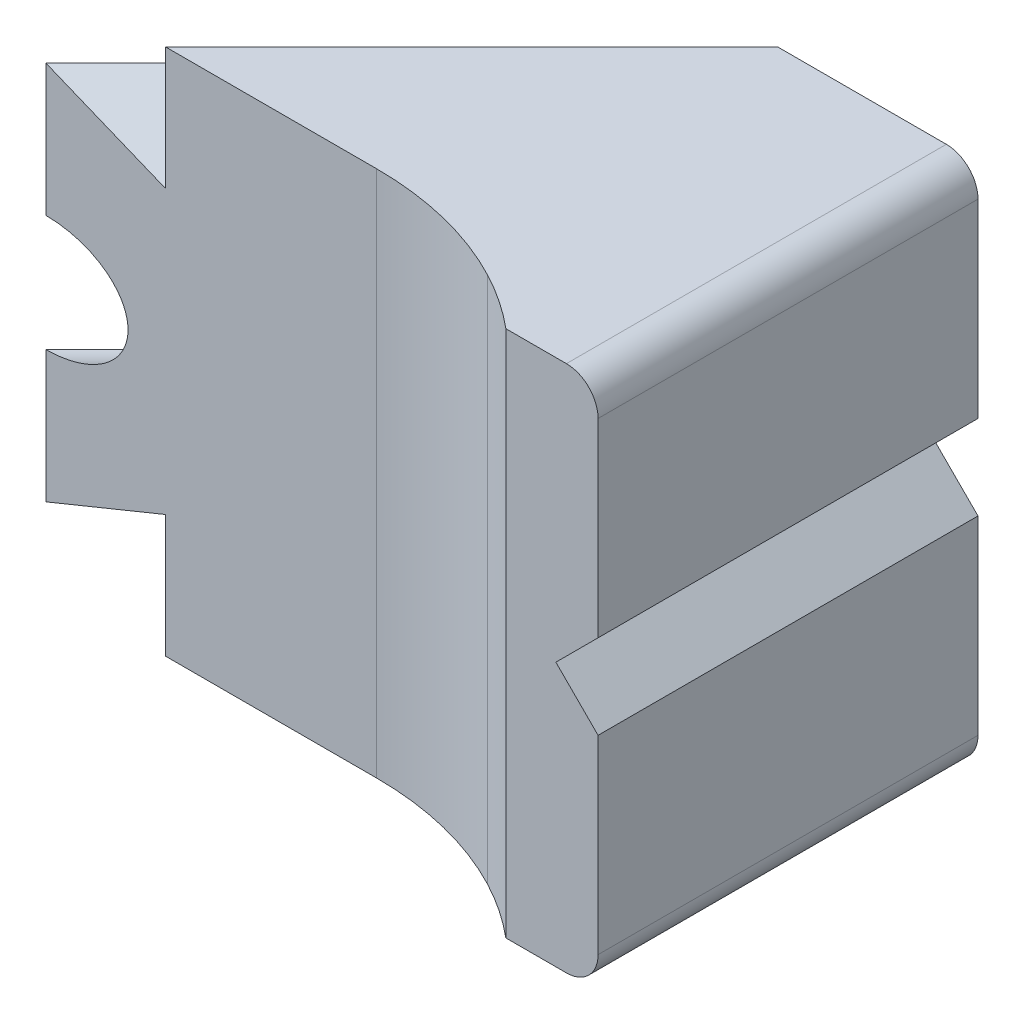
ISO-10303-21;
HEADER;
FILE_DESCRIPTION(('STEP AP214'),'2;1');
FILE_NAME('part.step','',(''),(''),'','','');
FILE_SCHEMA(('AUTOMOTIVE_DESIGN { 1 0 10303 214 1 1 1 1 }'));
ENDSEC;
DATA;
#1=APPLICATION_CONTEXT('core data for automotive mechanical design processes');
#2=APPLICATION_PROTOCOL_DEFINITION('international standard','automotive_design',2000,#1);
#3=PRODUCT_CONTEXT('',#1,'mechanical');
#4=PRODUCT('Part','Part','',(#3));
#5=PRODUCT_RELATED_PRODUCT_CATEGORY('part','',(#4));
#6=PRODUCT_DEFINITION_FORMATION('','',#4);
#7=PRODUCT_DEFINITION_CONTEXT('part definition',#1,'design');
#8=PRODUCT_DEFINITION('design','',#6,#7);
#9=PRODUCT_DEFINITION_SHAPE('','',#8);
#10=(LENGTH_UNIT() NAMED_UNIT(*) SI_UNIT(.MILLI.,.METRE.));
#11=(NAMED_UNIT(*) PLANE_ANGLE_UNIT() SI_UNIT($,.RADIAN.));
#12=(NAMED_UNIT(*) SI_UNIT($,.STERADIAN.) SOLID_ANGLE_UNIT());
#13=UNCERTAINTY_MEASURE_WITH_UNIT(LENGTH_MEASURE(1.E-05),#10,'distance_accuracy_value','');
#14=(GEOMETRIC_REPRESENTATION_CONTEXT(3) GLOBAL_UNCERTAINTY_ASSIGNED_CONTEXT((#13)) GLOBAL_UNIT_ASSIGNED_CONTEXT((#10,
#11,#12)) REPRESENTATION_CONTEXT('',''));
#15=CARTESIAN_POINT('',(0.,0.,0.));
#16=DIRECTION('',(0.,0.,1.));
#17=DIRECTION('',(1.,0.,0.));
#18=AXIS2_PLACEMENT_3D('',#15,#16,#17);
#19=CARTESIAN_POINT('',(15.1568542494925,-12.5,0.));
#20=DIRECTION('',(1.,0.,0.));
#21=DIRECTION('',(0.,1.,0.));
#22=AXIS2_PLACEMENT_3D('',#19,#20,#21);
#23=PLANE('',#22);
#24=DIRECTION('',(0.,0.,1.));
#25=VECTOR('',#24,1.);
#26=CARTESIAN_POINT('',(15.1568542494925,2.0000000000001,0.));
#27=LINE('',#26,#25);
#28=CARTESIAN_POINT('',(15.1568542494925,2.0000000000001,0.));
#29=VERTEX_POINT('',#28);
#30=CARTESIAN_POINT('',(15.1568542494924,2.0000000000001,18.));
#31=VERTEX_POINT('',#30);
#32=EDGE_CURVE('E331',#29,#31,#27,.T.);
#33=ORIENTED_EDGE('',*,*,#32,.F.);
#34=DIRECTION('',(0.,1.,0.));
#35=VECTOR('',#34,1.);
#36=CARTESIAN_POINT('',(15.1568542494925,-12.5,0.));
#37=LINE('',#36,#35);
#38=CARTESIAN_POINT('',(15.1568542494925,11.,0.));
#39=VERTEX_POINT('',#38);
#40=EDGE_CURVE('E354',#29,#39,#37,.T.);
#41=ORIENTED_EDGE('',*,*,#40,.T.);
#42=DIRECTION('',(0.,0.,1.));
#43=VECTOR('',#42,1.);
#44=CARTESIAN_POINT('',(15.1568542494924,11.,18.));
#45=LINE('',#44,#43);
#46=CARTESIAN_POINT('',(15.1568542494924,11.,18.));
#47=VERTEX_POINT('',#46);
#48=EDGE_CURVE('E370',#39,#47,#45,.T.);
#49=ORIENTED_EDGE('',*,*,#48,.T.);
#50=DIRECTION('',(0.,-1.,0.));
#51=VECTOR('',#50,1.);
#52=CARTESIAN_POINT('',(15.1568542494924,-12.5,18.));
#53=LINE('',#52,#51);
#54=EDGE_CURVE('E359',#47,#31,#53,.T.);
#55=ORIENTED_EDGE('',*,*,#54,.T.);
#56=EDGE_LOOP('',(#33,#41,#49,#55));
#57=FACE_BOUND('',#56,.T.);
#58=ADVANCED_FACE('F14',(#57),#23,.T.);
#59=DIRECTION('',(0.,0.,1.));
#60=VECTOR('',#59,1.);
#61=CARTESIAN_POINT('',(15.1568542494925,-1.99999999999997,0.));
#62=LINE('',#61,#60);
#63=CARTESIAN_POINT('',(15.1568542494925,-1.99999999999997,0.));
#64=VERTEX_POINT('',#63);
#65=CARTESIAN_POINT('',(15.1568542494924,-1.99999999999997,18.));
#66=VERTEX_POINT('',#65);
#67=EDGE_CURVE('E332',#64,#66,#62,.T.);
#68=ORIENTED_EDGE('',*,*,#67,.T.);
#69=CARTESIAN_POINT('',(15.1568542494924,-11.,18.));
#70=VERTEX_POINT('',#69);
#71=EDGE_CURVE('E358',#66,#70,#53,.T.);
#72=ORIENTED_EDGE('',*,*,#71,.T.);
#73=DIRECTION('',(0.,0.,-1.));
#74=VECTOR('',#73,1.);
#75=CARTESIAN_POINT('',(15.1568542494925,-11.,0.));
#76=LINE('',#75,#74);
#77=CARTESIAN_POINT('',(15.1568542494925,-11.,0.));
#78=VERTEX_POINT('',#77);
#79=EDGE_CURVE('E373',#70,#78,#76,.T.);
#80=ORIENTED_EDGE('',*,*,#79,.T.);
#81=EDGE_CURVE('E355',#78,#64,#37,.T.);
#82=ORIENTED_EDGE('',*,*,#81,.T.);
#83=EDGE_LOOP('',(#68,#72,#80,#82));
#84=FACE_BOUND('',#83,.T.);
#85=ADVANCED_FACE('F418',(#84),#23,.T.);
#86=CARTESIAN_POINT('',(13.1568542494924,0.,0.));
#87=DIRECTION('',(-0.707106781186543,-0.707106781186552,0.));
#88=DIRECTION('',(0.707106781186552,-0.707106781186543,0.));
#89=AXIS2_PLACEMENT_3D('',#86,#87,#88);
#90=PLANE('',#89);
#91=DIRECTION('',(0.707106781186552,-0.707106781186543,0.));
#92=VECTOR('',#91,1.);
#93=CARTESIAN_POINT('',(13.1568542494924,0.,18.));
#94=LINE('',#93,#92);
#95=CARTESIAN_POINT('',(13.1568542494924,0.,18.));
#96=VERTEX_POINT('',#95);
#97=EDGE_CURVE('E323',#96,#66,#94,.T.);
#98=ORIENTED_EDGE('',*,*,#97,.T.);
#99=ORIENTED_EDGE('',*,*,#67,.F.);
#100=DIRECTION('',(0.707106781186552,-0.707106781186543,0.));
#101=VECTOR('',#100,1.);
#102=CARTESIAN_POINT('',(13.1568542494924,0.,0.));
#103=LINE('',#102,#101);
#104=CARTESIAN_POINT('',(13.1568542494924,0.,0.));
#105=VERTEX_POINT('',#104);
#106=EDGE_CURVE('E328',#105,#64,#103,.T.);
#107=ORIENTED_EDGE('',*,*,#106,.F.);
#108=DIRECTION('',(0.,0.,1.));
#109=VECTOR('',#108,1.);
#110=CARTESIAN_POINT('',(13.1568542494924,0.,0.));
#111=LINE('',#110,#109);
#112=EDGE_CURVE('E336',#105,#96,#111,.T.);
#113=ORIENTED_EDGE('',*,*,#112,.T.);
#114=EDGE_LOOP('',(#98,#99,#107,#113));
#115=FACE_BOUND('',#114,.T.);
#116=ADVANCED_FACE('F698',(#115),#90,.F.);
#117=CARTESIAN_POINT('',(15.1568542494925,2.0000000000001,0.));
#118=DIRECTION('',(-0.707106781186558,0.707106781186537,0.));
#119=DIRECTION('',(-0.707106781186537,-0.707106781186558,0.));
#120=AXIS2_PLACEMENT_3D('',#117,#118,#119);
#121=PLANE('',#120);
#122=DIRECTION('',(-0.707106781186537,-0.707106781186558,0.));
#123=VECTOR('',#122,1.);
#124=CARTESIAN_POINT('',(15.1568542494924,2.0000000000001,18.));
#125=LINE('',#124,#123);
#126=EDGE_CURVE('E252',#31,#96,#125,.T.);
#127=ORIENTED_EDGE('',*,*,#126,.T.);
#128=ORIENTED_EDGE('',*,*,#112,.F.);
#129=DIRECTION('',(-0.707106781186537,-0.707106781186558,0.));
#130=VECTOR('',#129,1.);
#131=CARTESIAN_POINT('',(15.1568542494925,2.0000000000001,0.));
#132=LINE('',#131,#130);
#133=EDGE_CURVE('E325',#29,#105,#132,.T.);
#134=ORIENTED_EDGE('',*,*,#133,.F.);
#135=ORIENTED_EDGE('',*,*,#32,.T.);
#136=EDGE_LOOP('',(#127,#128,#134,#135));
#137=FACE_BOUND('',#136,.T.);
#138=ADVANCED_FACE('F413',(#137),#121,.F.);
#139=CARTESIAN_POINT('',(13.6568542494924,-11.,0.));
#140=DIRECTION('',(0.,0.,1.));
#141=DIRECTION('',(0.,-1.,0.));
#142=AXIS2_PLACEMENT_3D('',#139,#140,#141);
#143=CYLINDRICAL_SURFACE('',#142,1.5);
#144=CARTESIAN_POINT('',(13.6568542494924,-11.,18.));
#145=DIRECTION('',(0.,0.,-1.));
#146=DIRECTION('',(-1.,0.,0.));
#147=AXIS2_PLACEMENT_3D('',#144,#145,#146);
#148=CIRCLE('',#147,1.5);
#149=CARTESIAN_POINT('',(13.6568542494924,-12.5,18.));
#150=VERTEX_POINT('',#149);
#151=EDGE_CURVE('E385',#150,#70,#148,.F.);
#152=ORIENTED_EDGE('',*,*,#151,.F.);
#153=DIRECTION('',(0.,0.,-1.));
#154=VECTOR('',#153,1.);
#155=CARTESIAN_POINT('',(13.6568542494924,-12.5,18.));
#156=LINE('',#155,#154);
#157=CARTESIAN_POINT('',(13.6568542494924,-12.5,0.));
#158=VERTEX_POINT('',#157);
#159=EDGE_CURVE('E381',#158,#150,#156,.F.);
#160=ORIENTED_EDGE('',*,*,#159,.F.);
#161=CARTESIAN_POINT('',(13.6568542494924,-11.,0.));
#162=DIRECTION('',(0.,0.,1.));
#163=DIRECTION('',(1.,0.,0.));
#164=AXIS2_PLACEMENT_3D('',#161,#162,#163);
#165=CIRCLE('',#164,1.5);
#166=EDGE_CURVE('E379',#78,#158,#165,.F.);
#167=ORIENTED_EDGE('',*,*,#166,.F.);
#168=ORIENTED_EDGE('',*,*,#79,.F.);
#169=EDGE_LOOP('',(#152,#160,#167,#168));
#170=FACE_BOUND('',#169,.T.);
#171=ADVANCED_FACE('F422',(#170),#143,.T.);
#172=CARTESIAN_POINT('',(1.15685424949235,-12.5,29.5));
#173=DIRECTION('',(0.,1.,0.));
#174=DIRECTION('',(-1.,0.,0.));
#175=AXIS2_PLACEMENT_3D('',#172,#173,#174);
#176=CYLINDRICAL_SURFACE('',#175,15.);
#177=DIRECTION('',(0.,1.,0.));
#178=VECTOR('',#177,1.);
#179=CARTESIAN_POINT('',(8.15685424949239,-12.5,16.2335008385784));
#180=LINE('',#179,#178);
#181=CARTESIAN_POINT('',(8.15685424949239,-12.5,16.2335008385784));
#182=VERTEX_POINT('',#181);
#183=CARTESIAN_POINT('',(8.15685424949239,12.5,16.2335008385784));
#184=VERTEX_POINT('',#183);
#185=EDGE_CURVE('E344',#182,#184,#180,.T.);
#186=ORIENTED_EDGE('',*,*,#185,.F.);
#187=CARTESIAN_POINT('',(1.15685424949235,-12.5,29.5));
#188=DIRECTION('',(0.,1.,0.));
#189=DIRECTION('',(-1.,0.,0.));
#190=AXIS2_PLACEMENT_3D('',#187,#188,#189);
#191=CIRCLE('',#190,15.);
#192=CARTESIAN_POINT('',(10.7875343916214,-12.5,18.));
#193=VERTEX_POINT('',#192);
#194=EDGE_CURVE('E340',#193,#182,#191,.T.);
#195=ORIENTED_EDGE('',*,*,#194,.F.);
#196=DIRECTION('',(0.,1.,0.));
#197=VECTOR('',#196,1.);
#198=CARTESIAN_POINT('',(10.7875343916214,-12.5,18.));
#199=LINE('',#198,#197);
#200=CARTESIAN_POINT('',(10.7875343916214,12.5,18.));
#201=VERTEX_POINT('',#200);
#202=EDGE_CURVE('E343',#193,#201,#199,.T.);
#203=ORIENTED_EDGE('',*,*,#202,.T.);
#204=CARTESIAN_POINT('',(1.15685424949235,12.5,29.5));
#205=DIRECTION('',(0.,1.,0.));
#206=DIRECTION('',(-1.,0.,0.));
#207=AXIS2_PLACEMENT_3D('',#204,#205,#206);
#208=CIRCLE('',#207,15.);
#209=EDGE_CURVE('E335',#201,#184,#208,.T.);
#210=ORIENTED_EDGE('',*,*,#209,.T.);
#211=EDGE_LOOP('',(#186,#195,#203,#210));
#212=FACE_BOUND('',#211,.T.);
#213=ADVANCED_FACE('F676',(#212),#176,.F.);
#214=CARTESIAN_POINT('',(13.6568542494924,11.,0.));
#215=DIRECTION('',(0.,0.,-1.));
#216=DIRECTION('',(-1.,0.,0.));
#217=AXIS2_PLACEMENT_3D('',#214,#215,#216);
#218=CYLINDRICAL_SURFACE('',#217,1.5);
#219=CARTESIAN_POINT('',(13.6568542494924,11.,0.));
#220=DIRECTION('',(0.,0.,1.));
#221=DIRECTION('',(1.,0.,0.));
#222=AXIS2_PLACEMENT_3D('',#219,#220,#221);
#223=CIRCLE('',#222,1.5);
#224=CARTESIAN_POINT('',(13.6568542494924,12.5,0.));
#225=VERTEX_POINT('',#224);
#226=EDGE_CURVE('E376',#225,#39,#223,.F.);
#227=ORIENTED_EDGE('',*,*,#226,.F.);
#228=DIRECTION('',(0.,0.,1.));
#229=VECTOR('',#228,1.);
#230=CARTESIAN_POINT('',(13.6568542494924,12.5,0.));
#231=LINE('',#230,#229);
#232=CARTESIAN_POINT('',(13.6568542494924,12.5,18.));
#233=VERTEX_POINT('',#232);
#234=EDGE_CURVE('E22',#233,#225,#231,.F.);
#235=ORIENTED_EDGE('',*,*,#234,.F.);
#236=CARTESIAN_POINT('',(13.6568542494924,11.,18.));
#237=DIRECTION('',(0.,0.,-1.));
#238=DIRECTION('',(-1.,0.,0.));
#239=AXIS2_PLACEMENT_3D('',#236,#237,#238);
#240=CIRCLE('',#239,1.5);
#241=EDGE_CURVE('E383',#47,#233,#240,.F.);
#242=ORIENTED_EDGE('',*,*,#241,.F.);
#243=ORIENTED_EDGE('',*,*,#48,.F.);
#244=EDGE_LOOP('',(#227,#235,#242,#243));
#245=FACE_BOUND('',#244,.T.);
#246=ADVANCED_FACE('F403',(#245),#218,.T.);
#247=CARTESIAN_POINT('',(15.1568542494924,-12.5,18.));
#248=DIRECTION('',(0.,0.,-1.));
#249=DIRECTION('',(-1.,0.,0.));
#250=AXIS2_PLACEMENT_3D('',#247,#248,#249);
#251=PLANE('',#250);
#252=ORIENTED_EDGE('',*,*,#71,.F.);
#253=ORIENTED_EDGE('',*,*,#97,.F.);
#254=ORIENTED_EDGE('',*,*,#126,.F.);
#255=ORIENTED_EDGE('',*,*,#54,.F.);
#256=ORIENTED_EDGE('',*,*,#241,.T.);
#257=DIRECTION('',(-1.,0.,0.));
#258=VECTOR('',#257,1.);
#259=CARTESIAN_POINT('',(15.1568542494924,12.5,18.));
#260=LINE('',#259,#258);
#261=EDGE_CURVE('E364',#233,#201,#260,.T.);
#262=ORIENTED_EDGE('',*,*,#261,.T.);
#263=ORIENTED_EDGE('',*,*,#202,.F.);
#264=DIRECTION('',(-1.,0.,0.));
#265=VECTOR('',#264,1.);
#266=CARTESIAN_POINT('',(15.1568542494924,-12.5,18.));
#267=LINE('',#266,#265);
#268=EDGE_CURVE('E362',#150,#193,#267,.T.);
#269=ORIENTED_EDGE('',*,*,#268,.F.);
#270=ORIENTED_EDGE('',*,*,#151,.T.);
#271=EDGE_LOOP('',(#252,#253,#254,#255,#256,#262,#263,#269,#270));
#272=FACE_BOUND('',#271,.T.);
#273=ADVANCED_FACE('F410',(#272),#251,.F.);
#274=CARTESIAN_POINT('',(15.1568542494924,12.5,18.));
#275=DIRECTION('',(0.,-1.,0.));
#276=DIRECTION('',(1.,0.,0.));
#277=AXIS2_PLACEMENT_3D('',#274,#275,#276);
#278=PLANE('',#277);
#279=ORIENTED_EDGE('',*,*,#261,.F.);
#280=ORIENTED_EDGE('',*,*,#234,.T.);
#281=DIRECTION('',(-1.,0.,0.));
#282=VECTOR('',#281,1.);
#283=CARTESIAN_POINT('',(15.1568542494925,12.5,0.));
#284=LINE('',#283,#282);
#285=CARTESIAN_POINT('',(5.65370849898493,12.5,0.));
#286=VERTEX_POINT('',#285);
#287=EDGE_CURVE('E366',#225,#286,#284,.T.);
#288=ORIENTED_EDGE('',*,*,#287,.T.);
#289=DIRECTION('',(-0.707106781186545,0.,-0.707106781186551));
#290=VECTOR('',#289,1.);
#291=CARTESIAN_POINT('',(2.82685424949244,12.5,-2.82685424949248));
#292=LINE('',#291,#290);
#293=CARTESIAN_POINT('',(5.65528137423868,12.5,0.00157287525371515));
#294=VERTEX_POINT('',#293);
#295=EDGE_CURVE('E219',#294,#286,#292,.T.);
#296=ORIENTED_EDGE('',*,*,#295,.F.);
#297=DIRECTION('',(-0.707106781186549,0.,0.707106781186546));
#298=VECTOR('',#297,1.);
#299=CARTESIAN_POINT('',(5.65528137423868,12.5,0.00157287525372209));
#300=LINE('',#299,#298);
#301=CARTESIAN_POINT('',(-8.84314575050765,12.5,14.5));
#302=VERTEX_POINT('',#301);
#303=EDGE_CURVE('E455',#294,#302,#300,.T.);
#304=ORIENTED_EDGE('',*,*,#303,.T.);
#305=DIRECTION('',(1.,0.,0.));
#306=VECTOR('',#305,1.);
#307=CARTESIAN_POINT('',(1.15685424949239,12.5,14.5));
#308=LINE('',#307,#306);
#309=CARTESIAN_POINT('',(1.15685424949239,12.5,14.5));
#310=VERTEX_POINT('',#309);
#311=EDGE_CURVE('E481',#302,#310,#308,.T.);
#312=ORIENTED_EDGE('',*,*,#311,.T.);
#313=CARTESIAN_POINT('',(1.15685424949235,12.5,29.5));
#314=DIRECTION('',(0.,-1.,0.));
#315=DIRECTION('',(-1.,0.,0.));
#316=AXIS2_PLACEMENT_3D('',#313,#314,#315);
#317=CIRCLE('',#316,15.);
#318=CARTESIAN_POINT('',(8.15021538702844,12.5,16.23));
#319=VERTEX_POINT('',#318);
#320=EDGE_CURVE('E483',#310,#319,#317,.T.);
#321=ORIENTED_EDGE('',*,*,#320,.T.);
#322=DIRECTION('',(1.,0.,0.));
#323=VECTOR('',#322,1.);
#324=CARTESIAN_POINT('',(8.15021538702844,12.5,16.23));
#325=LINE('',#324,#323);
#326=CARTESIAN_POINT('',(8.15685424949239,12.5,16.23));
#327=VERTEX_POINT('',#326);
#328=EDGE_CURVE('E485',#319,#327,#325,.T.);
#329=ORIENTED_EDGE('',*,*,#328,.T.);
#330=DIRECTION('',(0.,0.,-1.));
#331=VECTOR('',#330,1.);
#332=CARTESIAN_POINT('',(8.15685424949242,12.5,3.));
#333=LINE('',#332,#331);
#334=EDGE_CURVE('E347',#184,#327,#333,.T.);
#335=ORIENTED_EDGE('',*,*,#334,.F.);
#336=ORIENTED_EDGE('',*,*,#209,.F.);
#337=EDGE_LOOP('',(#279,#280,#288,#296,#304,#312,#321,#329,#335,#336));
#338=FACE_BOUND('',#337,.T.);
#339=ADVANCED_FACE('F391',(#338),#278,.F.);
#340=CARTESIAN_POINT('',(15.1568542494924,-12.5,18.));
#341=DIRECTION('',(0.,1.,0.));
#342=DIRECTION('',(0.,0.,1.));
#343=AXIS2_PLACEMENT_3D('',#340,#341,#342);
#344=PLANE('',#343);
#345=DIRECTION('',(-1.,0.,0.));
#346=VECTOR('',#345,1.);
#347=CARTESIAN_POINT('',(15.1568542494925,-12.5,0.));
#348=LINE('',#347,#346);
#349=CARTESIAN_POINT('',(5.65370849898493,-12.5,0.));
#350=VERTEX_POINT('',#349);
#351=EDGE_CURVE('E368',#158,#350,#348,.T.);
#352=ORIENTED_EDGE('',*,*,#351,.F.);
#353=ORIENTED_EDGE('',*,*,#159,.T.);
#354=ORIENTED_EDGE('',*,*,#268,.T.);
#355=ORIENTED_EDGE('',*,*,#194,.T.);
#356=DIRECTION('',(0.,0.,-1.));
#357=VECTOR('',#356,1.);
#358=CARTESIAN_POINT('',(8.15685424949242,-12.5,3.));
#359=LINE('',#358,#357);
#360=CARTESIAN_POINT('',(8.15685424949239,-12.5,16.23));
#361=VERTEX_POINT('',#360);
#362=EDGE_CURVE('E351',#182,#361,#359,.T.);
#363=ORIENTED_EDGE('',*,*,#362,.T.);
#364=DIRECTION('',(1.,0.,0.));
#365=VECTOR('',#364,1.);
#366=CARTESIAN_POINT('',(8.15021538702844,-12.5,16.23));
#367=LINE('',#366,#365);
#368=CARTESIAN_POINT('',(8.15021538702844,-12.5,16.23));
#369=VERTEX_POINT('',#368);
#370=EDGE_CURVE('E479',#369,#361,#367,.T.);
#371=ORIENTED_EDGE('',*,*,#370,.F.);
#372=CARTESIAN_POINT('',(1.15685424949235,-12.5,29.5));
#373=DIRECTION('',(0.,-1.,0.));
#374=DIRECTION('',(-1.,0.,0.));
#375=AXIS2_PLACEMENT_3D('',#372,#373,#374);
#376=CIRCLE('',#375,15.);
#377=CARTESIAN_POINT('',(1.15685424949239,-12.5,14.5));
#378=VERTEX_POINT('',#377);
#379=EDGE_CURVE('E477',#378,#369,#376,.T.);
#380=ORIENTED_EDGE('',*,*,#379,.F.);
#381=DIRECTION('',(1.,0.,0.));
#382=VECTOR('',#381,1.);
#383=CARTESIAN_POINT('',(1.15685424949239,-12.5,14.5));
#384=LINE('',#383,#382);
#385=CARTESIAN_POINT('',(-8.84314575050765,-12.5,14.5));
#386=VERTEX_POINT('',#385);
#387=EDGE_CURVE('E475',#386,#378,#384,.T.);
#388=ORIENTED_EDGE('',*,*,#387,.F.);
#389=DIRECTION('',(-0.707106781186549,0.,0.707106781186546));
#390=VECTOR('',#389,1.);
#391=CARTESIAN_POINT('',(5.65528137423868,-12.5,0.00157287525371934));
#392=LINE('',#391,#390);
#393=CARTESIAN_POINT('',(5.65528137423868,-12.5,0.00157287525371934));
#394=VERTEX_POINT('',#393);
#395=EDGE_CURVE('E432',#394,#386,#392,.T.);
#396=ORIENTED_EDGE('',*,*,#395,.F.);
#397=DIRECTION('',(0.707106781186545,0.,0.70710678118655));
#398=VECTOR('',#397,1.);
#399=CARTESIAN_POINT('',(18.1552813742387,-12.5,12.5015728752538));
#400=LINE('',#399,#398);
#401=EDGE_CURVE('E264',#350,#394,#400,.T.);
#402=ORIENTED_EDGE('',*,*,#401,.F.);
#403=EDGE_LOOP('',(#352,#353,#354,#355,#363,#371,#380,#388,#396,#402));
#404=FACE_BOUND('',#403,.T.);
#405=ADVANCED_FACE('F16',(#404),#344,.F.);
#406=CARTESIAN_POINT('',(8.15685424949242,-12.5,3.));
#407=DIRECTION('',(1.,0.,0.));
#408=DIRECTION('',(0.,1.,0.));
#409=AXIS2_PLACEMENT_3D('',#406,#407,#408);
#410=PLANE('',#409);
#411=DIRECTION('',(0.,1.,0.));
#412=VECTOR('',#411,1.);
#413=CARTESIAN_POINT('',(8.15685424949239,-12.5,16.23));
#414=LINE('',#413,#412);
#415=EDGE_CURVE('E9',#361,#327,#414,.T.);
#416=ORIENTED_EDGE('',*,*,#415,.F.);
#417=ORIENTED_EDGE('',*,*,#362,.F.);
#418=ORIENTED_EDGE('',*,*,#185,.T.);
#419=ORIENTED_EDGE('',*,*,#334,.T.);
#420=EDGE_LOOP('',(#416,#417,#418,#419));
#421=FACE_BOUND('',#420,.T.);
#422=ADVANCED_FACE('F494',(#421),#410,.F.);
#423=CARTESIAN_POINT('',(15.1568542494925,-12.5,0.));
#424=DIRECTION('',(0.,0.,1.));
#425=DIRECTION('',(1.,0.,0.));
#426=AXIS2_PLACEMENT_3D('',#423,#424,#425);
#427=PLANE('',#426);
#428=ORIENTED_EDGE('',*,*,#133,.T.);
#429=ORIENTED_EDGE('',*,*,#106,.T.);
#430=ORIENTED_EDGE('',*,*,#81,.F.);
#431=ORIENTED_EDGE('',*,*,#166,.T.);
#432=ORIENTED_EDGE('',*,*,#351,.T.);
#433=DIRECTION('',(0.,-1.,0.));
#434=VECTOR('',#433,1.);
#435=CARTESIAN_POINT('',(5.65370849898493,12.5,0.));
#436=LINE('',#435,#434);
#437=CARTESIAN_POINT('',(5.65370849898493,-6.6918831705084,0.));
#438=VERTEX_POINT('',#437);
#439=EDGE_CURVE('E230',#438,#350,#436,.T.);
#440=ORIENTED_EDGE('',*,*,#439,.F.);
#441=DIRECTION('',(-0.925820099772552,-0.377964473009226,0.));
#442=VECTOR('',#441,1.);
#443=CARTESIAN_POINT('',(-4.905138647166,-11.0025144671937,0.));
#444=LINE('',#443,#442);
#445=CARTESIAN_POINT('',(0.,-9.,0.));
#446=VERTEX_POINT('',#445);
#447=EDGE_CURVE('E266',#438,#446,#444,.T.);
#448=ORIENTED_EDGE('',*,*,#447,.T.);
#449=DIRECTION('',(0.,1.,0.));
#450=VECTOR('',#449,1.);
#451=CARTESIAN_POINT('',(1.50920942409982E-13,-12.5,0.));
#452=LINE('',#451,#450);
#453=CARTESIAN_POINT('',(0.,9.,0.));
#454=VERTEX_POINT('',#453);
#455=EDGE_CURVE('E229',#446,#454,#452,.T.);
#456=ORIENTED_EDGE('',*,*,#455,.T.);
#457=DIRECTION('',(0.925820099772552,-0.377964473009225,0.));
#458=VECTOR('',#457,1.);
#459=CARTESIAN_POINT('',(-13.653316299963,14.5739430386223,0.));
#460=LINE('',#459,#458);
#461=CARTESIAN_POINT('',(5.65370849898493,6.6918831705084,0.));
#462=VERTEX_POINT('',#461);
#463=EDGE_CURVE('E249',#454,#462,#460,.T.);
#464=ORIENTED_EDGE('',*,*,#463,.T.);
#465=DIRECTION('',(0.,1.,0.));
#466=VECTOR('',#465,1.);
#467=CARTESIAN_POINT('',(5.65370849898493,12.5,0.));
#468=LINE('',#467,#466);
#469=EDGE_CURVE('E402',#462,#286,#468,.T.);
#470=ORIENTED_EDGE('',*,*,#469,.T.);
#471=ORIENTED_EDGE('',*,*,#287,.F.);
#472=ORIENTED_EDGE('',*,*,#226,.T.);
#473=ORIENTED_EDGE('',*,*,#40,.F.);
#474=EDGE_LOOP('',(#428,#429,#430,#431,#432,#440,#448,#456,#464,#470,#471,#472,#473));
#475=FACE_BOUND('',#474,.T.);
#476=ADVANCED_FACE('F399',(#475),#427,.F.);
#477=CARTESIAN_POINT('',(-7.2931951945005,2.33001662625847,6.85756240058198));
#478=DIRECTION('',(0.70710678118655,0.,-0.707106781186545));
#479=DIRECTION('',(0.270856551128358,0.923728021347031,0.270856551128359));
#480=AXIS2_PLACEMENT_3D('',#477,#478,#479);
#481=PLANE('',#480);
#482=DIRECTION('',(-0.561155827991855,-0.6084474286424,-0.561155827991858));
#483=VECTOR('',#482,1.);
#484=CARTESIAN_POINT('',(-7.2931951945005,2.33001662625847,6.85756240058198));
#485=LINE('',#484,#483);
#486=CARTESIAN_POINT('',(-7.2931951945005,2.33001662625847,6.85756240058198));
#487=VERTEX_POINT('',#486);
#488=CARTESIAN_POINT('',(-8.61191139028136,0.900165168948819,5.5388462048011));
#489=VERTEX_POINT('',#488);
#490=EDGE_CURVE('E285',#487,#489,#485,.T.);
#491=ORIENTED_EDGE('',*,*,#490,.T.);
#492=DIRECTION('',(0.0920185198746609,-0.991496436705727,0.0920185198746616));
#493=VECTOR('',#492,1.);
#494=CARTESIAN_POINT('',(-8.61191139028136,0.900165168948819,5.5388462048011));
#495=LINE('',#494,#493);
#496=CARTESIAN_POINT('',(-8.39566786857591,-1.42985145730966,5.75508972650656));
#497=VERTEX_POINT('',#496);
#498=EDGE_CURVE('E288',#489,#497,#495,.T.);
#499=ORIENTED_EDGE('',*,*,#498,.T.);
#500=DIRECTION('',(0.653174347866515,-0.383049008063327,0.65317434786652));
#501=VECTOR('',#500,1.);
#502=CARTESIAN_POINT('',(-8.39566786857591,-1.42985145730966,5.75508972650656));
#503=LINE('',#502,#501);
#504=CARTESIAN_POINT('',(-6.86070815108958,-2.33001662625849,7.29004944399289));
#505=VERTEX_POINT('',#504);
#506=EDGE_CURVE('E291',#497,#505,#503,.T.);
#507=ORIENTED_EDGE('',*,*,#506,.T.);
#508=DIRECTION('',(0.561155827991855,0.6084474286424,0.561155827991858));
#509=VECTOR('',#508,1.);
#510=CARTESIAN_POINT('',(-6.86070815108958,-2.33001662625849,7.29004944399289));
#511=LINE('',#510,#509);
#512=CARTESIAN_POINT('',(-5.54199195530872,-0.900165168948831,8.60876563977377));
#513=VERTEX_POINT('',#512);
#514=EDGE_CURVE('E294',#505,#513,#511,.T.);
#515=ORIENTED_EDGE('',*,*,#514,.T.);
#516=DIRECTION('',(-0.0920185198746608,0.991496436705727,-0.0920185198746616));
#517=VECTOR('',#516,1.);
#518=CARTESIAN_POINT('',(-5.54199195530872,-0.900165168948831,8.60876563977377));
#519=LINE('',#518,#517);
#520=CARTESIAN_POINT('',(-5.75823547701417,1.42985145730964,8.39252211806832));
#521=VERTEX_POINT('',#520);
#522=EDGE_CURVE('E297',#513,#521,#519,.T.);
#523=ORIENTED_EDGE('',*,*,#522,.T.);
#524=DIRECTION('',(-0.653174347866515,0.383049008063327,-0.65317434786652));
#525=VECTOR('',#524,1.);
#526=CARTESIAN_POINT('',(-5.75823547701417,1.42985145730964,8.39252211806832));
#527=LINE('',#526,#525);
#528=EDGE_CURVE('E300',#521,#487,#527,.T.);
#529=ORIENTED_EDGE('',*,*,#528,.T.);
#530=EDGE_LOOP('',(#491,#499,#507,#515,#523,#529));
#531=FACE_BOUND('',#530,.T.);
#532=ADVANCED_FACE('F542',(#531),#481,.F.);
#533=CARTESIAN_POINT('',(-8.61191139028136,0.900165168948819,5.5388462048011));
#534=DIRECTION('',(-0.701093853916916,-0.130133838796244,-0.70109385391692));
#535=DIRECTION('',(0.0920185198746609,-0.991496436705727,0.0920185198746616));
#536=AXIS2_PLACEMENT_3D('',#533,#534,#535);
#537=PLANE('',#536);
#538=DIRECTION('',(0.0920185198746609,-0.991496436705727,0.0920185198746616));
#539=VECTOR('',#538,1.);
#540=CARTESIAN_POINT('',(-11.4403385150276,0.900165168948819,8.36727332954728));
#541=LINE('',#540,#539);
#542=CARTESIAN_POINT('',(-11.4403385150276,0.900165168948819,8.36727332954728));
#543=VERTEX_POINT('',#542);
#544=CARTESIAN_POINT('',(-11.2240949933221,-1.42985145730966,8.58351685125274));
#545=VERTEX_POINT('',#544);
#546=EDGE_CURVE('E270',#543,#545,#541,.T.);
#547=ORIENTED_EDGE('',*,*,#546,.T.);
#548=DIRECTION('',(-0.70710678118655,0.,0.707106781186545));
#549=VECTOR('',#548,1.);
#550=CARTESIAN_POINT('',(-8.39566786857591,-1.42985145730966,5.75508972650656));
#551=LINE('',#550,#549);
#552=EDGE_CURVE('E313',#497,#545,#551,.T.);
#553=ORIENTED_EDGE('',*,*,#552,.F.);
#554=ORIENTED_EDGE('',*,*,#498,.F.);
#555=DIRECTION('',(-0.70710678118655,0.,0.707106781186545));
#556=VECTOR('',#555,1.);
#557=CARTESIAN_POINT('',(-8.61191139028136,0.900165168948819,5.5388462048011));
#558=LINE('',#557,#556);
#559=EDGE_CURVE('E303',#489,#543,#558,.T.);
#560=ORIENTED_EDGE('',*,*,#559,.T.);
#561=EDGE_LOOP('',(#547,#553,#554,#560));
#562=FACE_BOUND('',#561,.T.);
#563=ADVANCED_FACE('F544',(#562),#537,.F.);
#564=CARTESIAN_POINT('',(-8.39566786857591,-1.42985145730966,5.75508972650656));
#565=DIRECTION('',(-0.270856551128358,-0.923728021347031,-0.270856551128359));
#566=DIRECTION('',(0.653174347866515,-0.383049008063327,0.65317434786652));
#567=AXIS2_PLACEMENT_3D('',#564,#565,#566);
#568=PLANE('',#567);
#569=DIRECTION('',(0.653174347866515,-0.383049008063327,0.65317434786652));
#570=VECTOR('',#569,1.);
#571=CARTESIAN_POINT('',(-11.2240949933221,-1.42985145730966,8.58351685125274));
#572=LINE('',#571,#570);
#573=CARTESIAN_POINT('',(-9.68913527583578,-2.33001662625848,10.1184765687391));
#574=VERTEX_POINT('',#573);
#575=EDGE_CURVE('E273',#545,#574,#572,.T.);
#576=ORIENTED_EDGE('',*,*,#575,.T.);
#577=DIRECTION('',(-0.70710678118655,0.,0.707106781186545));
#578=VECTOR('',#577,1.);
#579=CARTESIAN_POINT('',(-6.86070815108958,-2.33001662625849,7.29004944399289));
#580=LINE('',#579,#578);
#581=EDGE_CURVE('E311',#505,#574,#580,.T.);
#582=ORIENTED_EDGE('',*,*,#581,.F.);
#583=ORIENTED_EDGE('',*,*,#506,.F.);
#584=ORIENTED_EDGE('',*,*,#552,.T.);
#585=EDGE_LOOP('',(#576,#582,#583,#584));
#586=FACE_BOUND('',#585,.T.);
#587=ADVANCED_FACE('F552',(#586),#568,.F.);
#588=CARTESIAN_POINT('',(-6.86070815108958,-2.33001662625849,7.29004944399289));
#589=DIRECTION('',(0.430237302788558,-0.793594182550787,0.43023730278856));
#590=DIRECTION('',(0.561155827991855,0.6084474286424,0.561155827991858));
#591=AXIS2_PLACEMENT_3D('',#588,#589,#590);
#592=PLANE('',#591);
#593=DIRECTION('',(0.561155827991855,0.6084474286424,0.561155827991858));
#594=VECTOR('',#593,1.);
#595=CARTESIAN_POINT('',(-9.68913527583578,-2.33001662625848,10.1184765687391));
#596=LINE('',#595,#594);
#597=CARTESIAN_POINT('',(-8.37041908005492,-0.90016516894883,11.4371927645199));
#598=VERTEX_POINT('',#597);
#599=EDGE_CURVE('E276',#574,#598,#596,.T.);
#600=ORIENTED_EDGE('',*,*,#599,.T.);
#601=DIRECTION('',(-0.70710678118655,0.,0.707106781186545));
#602=VECTOR('',#601,1.);
#603=CARTESIAN_POINT('',(-5.54199195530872,-0.900165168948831,8.60876563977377));
#604=LINE('',#603,#602);
#605=EDGE_CURVE('E309',#513,#598,#604,.T.);
#606=ORIENTED_EDGE('',*,*,#605,.F.);
#607=ORIENTED_EDGE('',*,*,#514,.F.);
#608=ORIENTED_EDGE('',*,*,#581,.T.);
#609=EDGE_LOOP('',(#600,#606,#607,#608));
#610=FACE_BOUND('',#609,.T.);
#611=ADVANCED_FACE('F564',(#610),#592,.F.);
#612=CARTESIAN_POINT('',(-5.54199195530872,-0.900165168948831,8.60876563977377));
#613=DIRECTION('',(0.701093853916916,0.130133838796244,0.70109385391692));
#614=DIRECTION('',(-0.0920185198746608,0.991496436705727,-0.0920185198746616));
#615=AXIS2_PLACEMENT_3D('',#612,#613,#614);
#616=PLANE('',#615);
#617=DIRECTION('',(-0.0920185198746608,0.991496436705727,-0.0920185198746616));
#618=VECTOR('',#617,1.);
#619=CARTESIAN_POINT('',(-8.37041908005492,-0.90016516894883,11.4371927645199));
#620=LINE('',#619,#618);
#621=CARTESIAN_POINT('',(-8.58666260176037,1.42985145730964,11.2209492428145));
#622=VERTEX_POINT('',#621);
#623=EDGE_CURVE('E279',#598,#622,#620,.T.);
#624=ORIENTED_EDGE('',*,*,#623,.T.);
#625=DIRECTION('',(-0.70710678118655,0.,0.707106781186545));
#626=VECTOR('',#625,1.);
#627=CARTESIAN_POINT('',(-5.75823547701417,1.42985145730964,8.39252211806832));
#628=LINE('',#627,#626);
#629=EDGE_CURVE('E307',#521,#622,#628,.T.);
#630=ORIENTED_EDGE('',*,*,#629,.F.);
#631=ORIENTED_EDGE('',*,*,#522,.F.);
#632=ORIENTED_EDGE('',*,*,#605,.T.);
#633=EDGE_LOOP('',(#624,#630,#631,#632));
#634=FACE_BOUND('',#633,.T.);
#635=ADVANCED_FACE('F560',(#634),#616,.F.);
#636=CARTESIAN_POINT('',(-5.75823547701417,1.42985145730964,8.39252211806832));
#637=DIRECTION('',(0.270856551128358,0.923728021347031,0.270856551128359));
#638=DIRECTION('',(-0.70710678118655,0.,0.707106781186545));
#639=AXIS2_PLACEMENT_3D('',#636,#637,#638);
#640=PLANE('',#639);
#641=DIRECTION('',(-0.653174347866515,0.383049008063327,-0.65317434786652));
#642=VECTOR('',#641,1.);
#643=CARTESIAN_POINT('',(-8.58666260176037,1.42985145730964,11.2209492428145));
#644=LINE('',#643,#642);
#645=CARTESIAN_POINT('',(-10.1216223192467,2.33001662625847,9.68598952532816));
#646=VERTEX_POINT('',#645);
#647=EDGE_CURVE('E282',#622,#646,#644,.T.);
#648=ORIENTED_EDGE('',*,*,#647,.T.);
#649=DIRECTION('',(-0.70710678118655,0.,0.707106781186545));
#650=VECTOR('',#649,1.);
#651=CARTESIAN_POINT('',(-7.2931951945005,2.33001662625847,6.85756240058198));
#652=LINE('',#651,#650);
#653=EDGE_CURVE('E304',#487,#646,#652,.T.);
#654=ORIENTED_EDGE('',*,*,#653,.F.);
#655=ORIENTED_EDGE('',*,*,#528,.F.);
#656=ORIENTED_EDGE('',*,*,#629,.T.);
#657=EDGE_LOOP('',(#648,#654,#655,#656));
#658=FACE_BOUND('',#657,.T.);
#659=ADVANCED_FACE('F537',(#658),#640,.F.);
#660=CARTESIAN_POINT('',(-7.2931951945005,2.33001662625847,6.85756240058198));
#661=DIRECTION('',(-0.430237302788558,0.793594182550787,-0.43023730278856));
#662=DIRECTION('',(-0.561155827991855,-0.6084474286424,-0.561155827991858));
#663=AXIS2_PLACEMENT_3D('',#660,#661,#662);
#664=PLANE('',#663);
#665=DIRECTION('',(-0.561155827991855,-0.6084474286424,-0.561155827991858));
#666=VECTOR('',#665,1.);
#667=CARTESIAN_POINT('',(-10.1216223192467,2.33001662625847,9.68598952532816));
#668=LINE('',#667,#666);
#669=EDGE_CURVE('E268',#646,#543,#668,.T.);
#670=ORIENTED_EDGE('',*,*,#669,.T.);
#671=ORIENTED_EDGE('',*,*,#559,.F.);
#672=ORIENTED_EDGE('',*,*,#490,.F.);
#673=ORIENTED_EDGE('',*,*,#653,.T.);
#674=EDGE_LOOP('',(#670,#671,#672,#673));
#675=FACE_BOUND('',#674,.T.);
#676=ADVANCED_FACE('F528',(#675),#664,.F.);
#677=CARTESIAN_POINT('',(-2.83431098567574,0.,2.83116523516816));
#678=DIRECTION('',(-0.70710678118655,0.,0.707106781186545));
#679=DIRECTION('',(-0.270856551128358,-0.923728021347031,-0.270856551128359));
#680=AXIS2_PLACEMENT_3D('',#677,#678,#679);
#681=PLANE('',#680);
#682=CARTESIAN_POINT('',(-2.83431098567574,0.,2.83116523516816));
#683=DIRECTION('',(-0.70710678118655,0.,0.707106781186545));
#684=DIRECTION('',(-0.270856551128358,-0.923728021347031,-0.270856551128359));
#685=AXIS2_PLACEMENT_3D('',#682,#683,#684);
#686=CIRCLE('',#685,5.);
#687=CARTESIAN_POINT('',(-2.83273811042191,4.99999950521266,2.832738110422));
#688=VERTEX_POINT('',#687);
#689=CARTESIAN_POINT('',(-2.83273811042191,-4.99999950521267,2.832738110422));
#690=VERTEX_POINT('',#689);
#691=EDGE_CURVE('E306',#688,#690,#686,.T.);
#692=ORIENTED_EDGE('',*,*,#691,.F.);
#693=DIRECTION('',(0.,-1.,0.));
#694=VECTOR('',#693,1.);
#695=CARTESIAN_POINT('',(-2.83273811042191,-12.5,2.832738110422));
#696=LINE('',#695,#694);
#697=EDGE_CURVE('E254',#688,#690,#696,.T.);
#698=ORIENTED_EDGE('',*,*,#697,.T.);
#699=EDGE_LOOP('',(#692,#698));
#700=FACE_BOUND('',#699,.T.);
#701=ADVANCED_FACE('F526',(#700),#681,.F.);
#702=CARTESIAN_POINT('',(-9.90537879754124,0.,9.90223304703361));
#703=DIRECTION('',(0.70710678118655,0.,-0.707106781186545));
#704=DIRECTION('',(0.270856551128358,0.923728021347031,0.270856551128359));
#705=AXIS2_PLACEMENT_3D('',#702,#703,#704);
#706=CYLINDRICAL_SURFACE('',#705,5.);
#707=DIRECTION('',(-0.70710678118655,0.,0.707106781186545));
#708=VECTOR('',#707,1.);
#709=CARTESIAN_POINT('',(-2.83273811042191,-4.99999950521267,2.83273811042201));
#710=LINE('',#709,#708);
#711=CARTESIAN_POINT('',(-9.90380592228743,-4.99999950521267,9.90380592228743));
#712=VERTEX_POINT('',#711);
#713=EDGE_CURVE('E250',#712,#690,#710,.F.);
#714=ORIENTED_EDGE('',*,*,#713,.F.);
#715=CARTESIAN_POINT('',(-9.90537879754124,0.,9.90223304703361));
#716=DIRECTION('',(-0.70710678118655,0.,0.707106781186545));
#717=DIRECTION('',(-0.270856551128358,-0.923728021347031,-0.270856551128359));
#718=AXIS2_PLACEMENT_3D('',#715,#716,#717);
#719=CIRCLE('',#718,5.);
#720=CARTESIAN_POINT('',(-9.90380592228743,4.99999950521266,9.90380592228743));
#721=VERTEX_POINT('',#720);
#722=EDGE_CURVE('E258',#721,#712,#719,.T.);
#723=ORIENTED_EDGE('',*,*,#722,.F.);
#724=DIRECTION('',(-0.70710678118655,0.,0.707106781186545));
#725=VECTOR('',#724,1.);
#726=CARTESIAN_POINT('',(-2.83273811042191,4.99999950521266,2.83273811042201));
#727=LINE('',#726,#725);
#728=EDGE_CURVE('E253',#688,#721,#727,.T.);
#729=ORIENTED_EDGE('',*,*,#728,.F.);
#730=ORIENTED_EDGE('',*,*,#691,.T.);
#731=EDGE_LOOP('',(#714,#723,#729,#730));
#732=FACE_BOUND('',#731,.T.);
#733=ADVANCED_FACE('F521',(#732),#706,.T.);
#734=CARTESIAN_POINT('',(-9.90537879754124,0.,9.90223304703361));
#735=DIRECTION('',(-0.70710678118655,0.,0.707106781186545));
#736=DIRECTION('',(-0.270856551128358,-0.923728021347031,-0.270856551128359));
#737=AXIS2_PLACEMENT_3D('',#734,#735,#736);
#738=PLANE('',#737);
#739=DIRECTION('',(0.,-1.,0.));
#740=VECTOR('',#739,1.);
#741=CARTESIAN_POINT('',(-9.90380592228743,-12.5,9.90380592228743));
#742=LINE('',#741,#740);
#743=CARTESIAN_POINT('',(-9.90380592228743,-2.74999910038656,9.90380592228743));
#744=VERTEX_POINT('',#743);
#745=EDGE_CURVE('E261',#744,#712,#742,.T.);
#746=ORIENTED_EDGE('',*,*,#745,.F.);
#747=CARTESIAN_POINT('',(-9.90537879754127,0.,9.9022330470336));
#748=DIRECTION('',(-0.70710678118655,0.,0.707106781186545));
#749=DIRECTION('',(0.707106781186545,0.,0.70710678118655));
#750=AXIS2_PLACEMENT_3D('',#747,#748,#749);
#751=CIRCLE('',#750,2.75);
#752=CARTESIAN_POINT('',(-9.90380592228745,2.74999910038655,9.90380592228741));
#753=VERTEX_POINT('',#752);
#754=EDGE_CURVE('E470',#744,#753,#751,.T.);
#755=ORIENTED_EDGE('',*,*,#754,.T.);
#756=EDGE_CURVE('E257',#721,#753,#742,.T.);
#757=ORIENTED_EDGE('',*,*,#756,.F.);
#758=ORIENTED_EDGE('',*,*,#722,.T.);
#759=EDGE_LOOP('',(#746,#755,#757,#758));
#760=FACE_BOUND('',#759,.T.);
#761=ORIENTED_EDGE('',*,*,#669,.F.);
#762=ORIENTED_EDGE('',*,*,#647,.F.);
#763=ORIENTED_EDGE('',*,*,#623,.F.);
#764=ORIENTED_EDGE('',*,*,#599,.F.);
#765=ORIENTED_EDGE('',*,*,#575,.F.);
#766=ORIENTED_EDGE('',*,*,#546,.F.);
#767=EDGE_LOOP('',(#761,#762,#763,#764,#765,#766));
#768=FACE_BOUND('',#767,.T.);
#769=ADVANCED_FACE('F523',(#760,#768),#738,.T.);
#770=CARTESIAN_POINT('',(-15.3665728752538,0.,15.3634271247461));
#771=DIRECTION('',(0.70710678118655,0.,-0.707106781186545));
#772=DIRECTION('',(-0.707106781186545,0.,-0.70710678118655));
#773=AXIS2_PLACEMENT_3D('',#770,#771,#772);
#774=CYLINDRICAL_SURFACE('',#773,2.75);
#775=DIRECTION('',(0.70710678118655,0.,-0.707106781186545));
#776=VECTOR('',#775,1.);
#777=CARTESIAN_POINT('',(-15.365,-2.74999910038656,15.365));
#778=LINE('',#777,#776);
#779=CARTESIAN_POINT('',(-14.5,-2.74999910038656,14.5));
#780=VERTEX_POINT('',#779);
#781=EDGE_CURVE('E247',#744,#780,#778,.F.);
#782=ORIENTED_EDGE('',*,*,#781,.T.);
#783=CARTESIAN_POINT('',(-14.5031457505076,0.,14.5));
#784=DIRECTION('',(0.,0.,-1.));
#785=DIRECTION('',(1.,0.,0.));
#786=AXIS2_PLACEMENT_3D('',#783,#784,#785);
#787=ELLIPSE('',#786,3.88908729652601,2.75);
#788=CARTESIAN_POINT('',(-14.5,2.74999910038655,14.5));
#789=VERTEX_POINT('',#788);
#790=EDGE_CURVE('E235',#780,#789,#787,.F.);
#791=ORIENTED_EDGE('',*,*,#790,.T.);
#792=DIRECTION('',(0.70710678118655,0.,-0.707106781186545));
#793=VECTOR('',#792,1.);
#794=CARTESIAN_POINT('',(-15.365,2.74999910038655,15.365));
#795=LINE('',#794,#793);
#796=EDGE_CURVE('E239',#789,#753,#795,.T.);
#797=ORIENTED_EDGE('',*,*,#796,.T.);
#798=ORIENTED_EDGE('',*,*,#754,.F.);
#799=EDGE_LOOP('',(#782,#791,#797,#798));
#800=FACE_BOUND('',#799,.T.);
#801=ADVANCED_FACE('F514',(#800),#774,.F.);
#802=CARTESIAN_POINT('',(2.82685424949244,9.,-2.82685424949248));
#803=DIRECTION('',(-0.353553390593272,-0.86602540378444,-0.353553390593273));
#804=DIRECTION('',(0.925820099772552,-0.377964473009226,0.));
#805=AXIS2_PLACEMENT_3D('',#802,#803,#804);
#806=PLANE('',#805);
#807=DIRECTION('',(-0.707106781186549,0.,0.707106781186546));
#808=VECTOR('',#807,1.);
#809=CARTESIAN_POINT('',(5.65528137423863,6.69059892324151,0.00157287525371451));
#810=LINE('',#809,#808);
#811=CARTESIAN_POINT('',(5.65528137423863,6.69059892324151,0.00157287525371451));
#812=VERTEX_POINT('',#811);
#813=CARTESIAN_POINT('',(-8.84314575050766,6.69059892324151,14.5));
#814=VERTEX_POINT('',#813);
#815=EDGE_CURVE('E458',#812,#814,#810,.T.);
#816=ORIENTED_EDGE('',*,*,#815,.F.);
#817=DIRECTION('',(0.612372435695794,-0.5,0.612372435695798));
#818=VECTOR('',#817,1.);
#819=CARTESIAN_POINT('',(2.82685424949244,9.,-2.82685424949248));
#820=LINE('',#819,#818);
#821=EDGE_CURVE('E450',#462,#812,#820,.T.);
#822=ORIENTED_EDGE('',*,*,#821,.F.);
#823=ORIENTED_EDGE('',*,*,#463,.F.);
#824=DIRECTION('',(-0.707106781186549,0.,0.707106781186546));
#825=VECTOR('',#824,1.);
#826=CARTESIAN_POINT('',(2.82685424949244,9.,-2.82685424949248));
#827=LINE('',#826,#825);
#828=CARTESIAN_POINT('',(-14.5,9.,14.5));
#829=VERTEX_POINT('',#828);
#830=EDGE_CURVE('E454',#454,#829,#827,.T.);
#831=ORIENTED_EDGE('',*,*,#830,.T.);
#832=DIRECTION('',(-0.925820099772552,0.377964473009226,0.));
#833=VECTOR('',#832,1.);
#834=CARTESIAN_POINT('',(-2.30458408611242,4.02124230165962,14.5));
#835=LINE('',#834,#833);
#836=EDGE_CURVE('E466',#814,#829,#835,.T.);
#837=ORIENTED_EDGE('',*,*,#836,.F.);
#838=EDGE_LOOP('',(#816,#822,#823,#831,#837));
#839=FACE_BOUND('',#838,.T.);
#840=ADVANCED_FACE('F511',(#839),#806,.F.);
#841=CARTESIAN_POINT('',(-14.5,-12.5,14.5));
#842=DIRECTION('',(0.707106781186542,0.,0.707106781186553));
#843=DIRECTION('',(0.707106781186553,0.,-0.707106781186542));
#844=AXIS2_PLACEMENT_3D('',#841,#842,#843);
#845=PLANE('',#844);
#846=ORIENTED_EDGE('',*,*,#455,.F.);
#847=DIRECTION('',(-0.707106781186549,0.,0.707106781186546));
#848=VECTOR('',#847,1.);
#849=CARTESIAN_POINT('',(2.82685424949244,-9.,-2.82685424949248));
#850=LINE('',#849,#848);
#851=CARTESIAN_POINT('',(-14.5,-9.,14.5));
#852=VERTEX_POINT('',#851);
#853=EDGE_CURVE('E212',#446,#852,#850,.T.);
#854=ORIENTED_EDGE('',*,*,#853,.T.);
#855=DIRECTION('',(0.,-1.,0.));
#856=VECTOR('',#855,1.);
#857=CARTESIAN_POINT('',(-14.5,12.5,14.5));
#858=LINE('',#857,#856);
#859=EDGE_CURVE('E227',#780,#852,#858,.T.);
#860=ORIENTED_EDGE('',*,*,#859,.F.);
#861=ORIENTED_EDGE('',*,*,#781,.F.);
#862=ORIENTED_EDGE('',*,*,#745,.T.);
#863=ORIENTED_EDGE('',*,*,#713,.T.);
#864=ORIENTED_EDGE('',*,*,#697,.F.);
#865=ORIENTED_EDGE('',*,*,#728,.T.);
#866=ORIENTED_EDGE('',*,*,#756,.T.);
#867=ORIENTED_EDGE('',*,*,#796,.F.);
#868=EDGE_CURVE('E236',#829,#789,#858,.T.);
#869=ORIENTED_EDGE('',*,*,#868,.F.);
#870=ORIENTED_EDGE('',*,*,#830,.F.);
#871=EDGE_LOOP('',(#846,#854,#860,#861,#862,#863,#864,#865,#866,#867,#869,#870));
#872=FACE_BOUND('',#871,.T.);
#873=ADVANCED_FACE('F225',(#872),#845,.F.);
#874=CARTESIAN_POINT('',(2.82685424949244,-9.,-2.82685424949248));
#875=DIRECTION('',(-0.353553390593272,0.86602540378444,-0.353553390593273));
#876=DIRECTION('',(-0.925820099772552,-0.377964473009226,0.));
#877=AXIS2_PLACEMENT_3D('',#874,#875,#876);
#878=PLANE('',#877);
#879=ORIENTED_EDGE('',*,*,#853,.F.);
#880=ORIENTED_EDGE('',*,*,#447,.F.);
#881=DIRECTION('',(-0.612372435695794,-0.5,-0.612372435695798));
#882=VECTOR('',#881,1.);
#883=CARTESIAN_POINT('',(2.82685424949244,-9.,-2.82685424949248));
#884=LINE('',#883,#882);
#885=CARTESIAN_POINT('',(5.65528137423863,-6.69059892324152,0.00157287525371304));
#886=VERTEX_POINT('',#885);
#887=EDGE_CURVE('E441',#886,#438,#884,.T.);
#888=ORIENTED_EDGE('',*,*,#887,.F.);
#889=DIRECTION('',(-0.707106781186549,0.,0.707106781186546));
#890=VECTOR('',#889,1.);
#891=CARTESIAN_POINT('',(5.65528137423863,-6.69059892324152,0.00157287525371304));
#892=LINE('',#891,#890);
#893=CARTESIAN_POINT('',(-8.84314575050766,-6.69059892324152,14.5));
#894=VERTEX_POINT('',#893);
#895=EDGE_CURVE('E215',#886,#894,#892,.T.);
#896=ORIENTED_EDGE('',*,*,#895,.T.);
#897=DIRECTION('',(0.925820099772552,0.377964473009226,0.));
#898=VECTOR('',#897,1.);
#899=CARTESIAN_POINT('',(6.44359356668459,-0.449813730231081,14.5));
#900=LINE('',#899,#898);
#901=EDGE_CURVE('E209',#852,#894,#900,.T.);
#902=ORIENTED_EDGE('',*,*,#901,.F.);
#903=EDGE_LOOP('',(#879,#880,#888,#896,#902));
#904=FACE_BOUND('',#903,.T.);
#905=ADVANCED_FACE('F211',(#904),#878,.F.);
#906=CARTESIAN_POINT('',(2.82685424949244,-12.5,-2.82685424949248));
#907=DIRECTION('',(-0.70710678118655,0.,0.707106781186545));
#908=DIRECTION('',(0.707106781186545,0.,0.70710678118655));
#909=AXIS2_PLACEMENT_3D('',#906,#907,#908);
#910=PLANE('',#909);
#911=ORIENTED_EDGE('',*,*,#439,.T.);
#912=ORIENTED_EDGE('',*,*,#401,.T.);
#913=DIRECTION('',(0.,1.,0.));
#914=VECTOR('',#913,1.);
#915=CARTESIAN_POINT('',(5.65528137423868,-12.5,0.00157287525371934));
#916=LINE('',#915,#914);
#917=EDGE_CURVE('E438',#394,#886,#916,.T.);
#918=ORIENTED_EDGE('',*,*,#917,.T.);
#919=ORIENTED_EDGE('',*,*,#887,.T.);
#920=EDGE_LOOP('',(#911,#912,#918,#919));
#921=FACE_BOUND('',#920,.T.);
#922=ADVANCED_FACE('F436',(#921),#910,.T.);
#923=CARTESIAN_POINT('',(5.65528137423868,-12.5,0.00157287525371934));
#924=DIRECTION('',(0.707106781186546,0.,0.707106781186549));
#925=DIRECTION('',(0.707106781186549,0.,-0.707106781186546));
#926=AXIS2_PLACEMENT_3D('',#923,#924,#925);
#927=PLANE('',#926);
#928=ORIENTED_EDGE('',*,*,#895,.F.);
#929=ORIENTED_EDGE('',*,*,#917,.F.);
#930=ORIENTED_EDGE('',*,*,#395,.T.);
#931=DIRECTION('',(0.,-1.,0.));
#932=VECTOR('',#931,1.);
#933=CARTESIAN_POINT('',(-8.8431457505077,12.5,14.5));
#934=LINE('',#933,#932);
#935=EDGE_CURVE('E220',#894,#386,#934,.T.);
#936=ORIENTED_EDGE('',*,*,#935,.F.);
#937=EDGE_LOOP('',(#928,#929,#930,#936));
#938=FACE_BOUND('',#937,.T.);
#939=ADVANCED_FACE('F440',(#938),#927,.F.);
#940=CARTESIAN_POINT('',(2.82685424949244,12.5,-2.82685424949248));
#941=DIRECTION('',(0.707106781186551,0.,-0.707106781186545));
#942=DIRECTION('',(-0.707106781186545,0.,-0.707106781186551));
#943=AXIS2_PLACEMENT_3D('',#940,#941,#942);
#944=PLANE('',#943);
#945=ORIENTED_EDGE('',*,*,#821,.T.);
#946=DIRECTION('',(0.,1.,0.));
#947=VECTOR('',#946,1.);
#948=CARTESIAN_POINT('',(5.65528137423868,12.5,0.00157287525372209));
#949=LINE('',#948,#947);
#950=EDGE_CURVE('E452',#812,#294,#949,.T.);
#951=ORIENTED_EDGE('',*,*,#950,.T.);
#952=ORIENTED_EDGE('',*,*,#295,.T.);
#953=ORIENTED_EDGE('',*,*,#469,.F.);
#954=EDGE_LOOP('',(#945,#951,#952,#953));
#955=FACE_BOUND('',#954,.T.);
#956=ADVANCED_FACE('F507',(#955),#944,.F.);
#957=CARTESIAN_POINT('',(1.15685424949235,12.5,29.5));
#958=DIRECTION('',(0.,-1.,0.));
#959=DIRECTION('',(1.,0.,0.));
#960=AXIS2_PLACEMENT_3D('',#957,#958,#959);
#961=CYLINDRICAL_SURFACE('',#960,15.);
#962=ORIENTED_EDGE('',*,*,#379,.T.);
#963=DIRECTION('',(0.,-1.,0.));
#964=VECTOR('',#963,1.);
#965=CARTESIAN_POINT('',(8.15021538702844,12.5,16.23));
#966=LINE('',#965,#964);
#967=EDGE_CURVE('E241',#319,#369,#966,.T.);
#968=ORIENTED_EDGE('',*,*,#967,.F.);
#969=ORIENTED_EDGE('',*,*,#320,.F.);
#970=DIRECTION('',(0.,-1.,0.));
#971=VECTOR('',#970,1.);
#972=CARTESIAN_POINT('',(1.15685424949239,12.5,14.5));
#973=LINE('',#972,#971);
#974=EDGE_CURVE('E237',#310,#378,#973,.T.);
#975=ORIENTED_EDGE('',*,*,#974,.T.);
#976=EDGE_LOOP('',(#962,#968,#969,#975));
#977=FACE_BOUND('',#976,.T.);
#978=ADVANCED_FACE('F499',(#977),#961,.F.);
#979=CARTESIAN_POINT('',(1.15685424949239,12.5,14.5));
#980=DIRECTION('',(0.,0.,-1.));
#981=DIRECTION('',(0.,-1.,0.));
#982=AXIS2_PLACEMENT_3D('',#979,#980,#981);
#983=PLANE('',#982);
#984=ORIENTED_EDGE('',*,*,#859,.T.);
#985=ORIENTED_EDGE('',*,*,#901,.T.);
#986=ORIENTED_EDGE('',*,*,#935,.T.);
#987=ORIENTED_EDGE('',*,*,#387,.T.);
#988=ORIENTED_EDGE('',*,*,#974,.F.);
#989=ORIENTED_EDGE('',*,*,#311,.F.);
#990=DIRECTION('',(0.,-1.,0.));
#991=VECTOR('',#990,1.);
#992=CARTESIAN_POINT('',(-8.84314575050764,12.5,14.5));
#993=LINE('',#992,#991);
#994=EDGE_CURVE('E463',#302,#814,#993,.T.);
#995=ORIENTED_EDGE('',*,*,#994,.T.);
#996=ORIENTED_EDGE('',*,*,#836,.T.);
#997=ORIENTED_EDGE('',*,*,#868,.T.);
#998=ORIENTED_EDGE('',*,*,#790,.F.);
#999=EDGE_LOOP('',(#984,#985,#986,#987,#988,#989,#995,#996,#997,#998));
#1000=FACE_BOUND('',#999,.T.);
#1001=ADVANCED_FACE('F233',(#1000),#983,.F.);
#1002=CARTESIAN_POINT('',(5.65528137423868,12.5,0.00157287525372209));
#1003=DIRECTION('',(0.707106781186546,0.,0.707106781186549));
#1004=DIRECTION('',(0.707106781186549,0.,-0.707106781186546));
#1005=AXIS2_PLACEMENT_3D('',#1002,#1003,#1004);
#1006=PLANE('',#1005);
#1007=ORIENTED_EDGE('',*,*,#303,.F.);
#1008=ORIENTED_EDGE('',*,*,#950,.F.);
#1009=ORIENTED_EDGE('',*,*,#815,.T.);
#1010=ORIENTED_EDGE('',*,*,#994,.F.);
#1011=EDGE_LOOP('',(#1007,#1008,#1009,#1010));
#1012=FACE_BOUND('',#1011,.T.);
#1013=ADVANCED_FACE('F503',(#1012),#1006,.F.);
#1014=CARTESIAN_POINT('',(8.15021538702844,12.5,16.23));
#1015=DIRECTION('',(0.,0.,-1.));
#1016=DIRECTION('',(0.,-1.,0.));
#1017=AXIS2_PLACEMENT_3D('',#1014,#1015,#1016);
#1018=PLANE('',#1017);
#1019=ORIENTED_EDGE('',*,*,#370,.T.);
#1020=ORIENTED_EDGE('',*,*,#415,.T.);
#1021=ORIENTED_EDGE('',*,*,#328,.F.);
#1022=ORIENTED_EDGE('',*,*,#967,.T.);
#1023=EDGE_LOOP('',(#1019,#1020,#1021,#1022));
#1024=FACE_BOUND('',#1023,.T.);
#1025=ADVANCED_FACE('F489',(#1024),#1018,.F.);
#1026=CLOSED_SHELL('',(#58,#85,#116,#138,#171,#213,#246,#273,#339,#405,#422,#476,#532,#563,#587,
#611,#635,#659,#676,#701,#733,#769,#801,#840,#873,#905,#922,#939,#956,#978,#1001,#1013,#1025));
#1027=MANIFOLD_SOLID_BREP('B1',#1026);
#1028=ADVANCED_BREP_SHAPE_REPRESENTATION('',(#18,#1027),#14);
#1029=SHAPE_DEFINITION_REPRESENTATION(#9,#1028);
ENDSEC;
END-ISO-10303-21;
